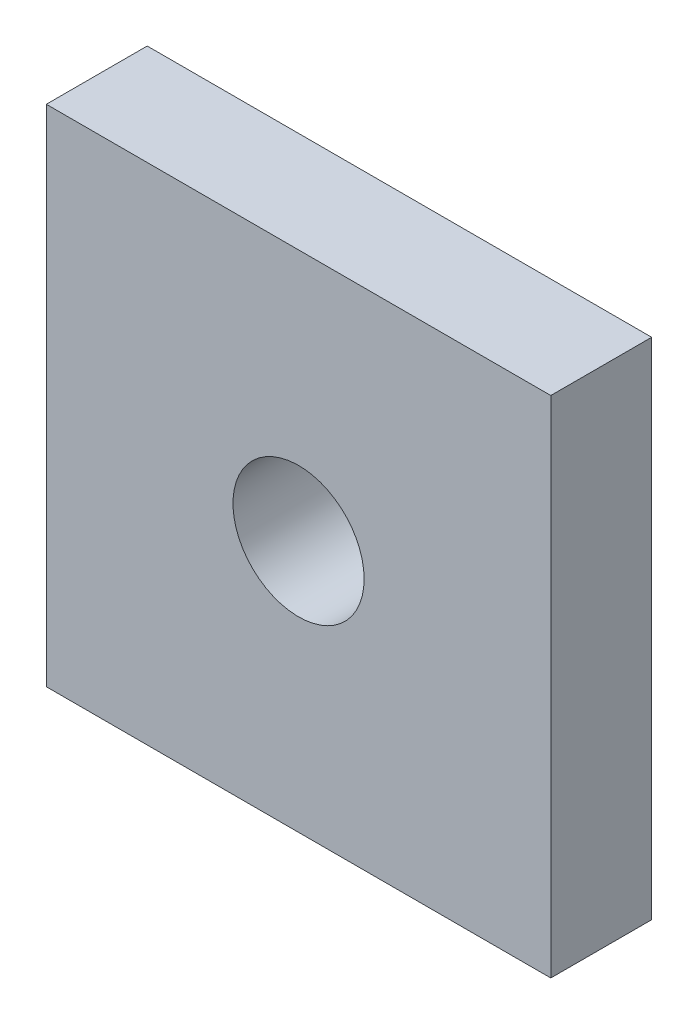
from build123d import *

# Parameters (mm, degrees)
ESQUISSE1_W             = 25
ESQUISSE1_H             = 25
BOSS_EXTRU_1_DEPTH      = 5
ESQUISSE2_R             = 3.25
ENL_V_MAT_EXTRU_1_DEPTH = 19.371173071


with BuildPart() as part:
    # Esquisse1 → Boss.-Extru.1 (new body)
    with BuildSketch(Plane.XY):
        Rectangle(ESQUISSE1_W, ESQUISSE1_H)
    extrude(amount=BOSS_EXTRU_1_DEPTH)

    # Esquisse2 → Enl_v. mat.-Extru.1 (cut, through all)
    with BuildSketch(Plane.XY.offset(5)):
        Circle(ESQUISSE2_R)
    extrude(amount=-ENL_V_MAT_EXTRU_1_DEPTH, mode=Mode.SUBTRACT)


solid = part.part
